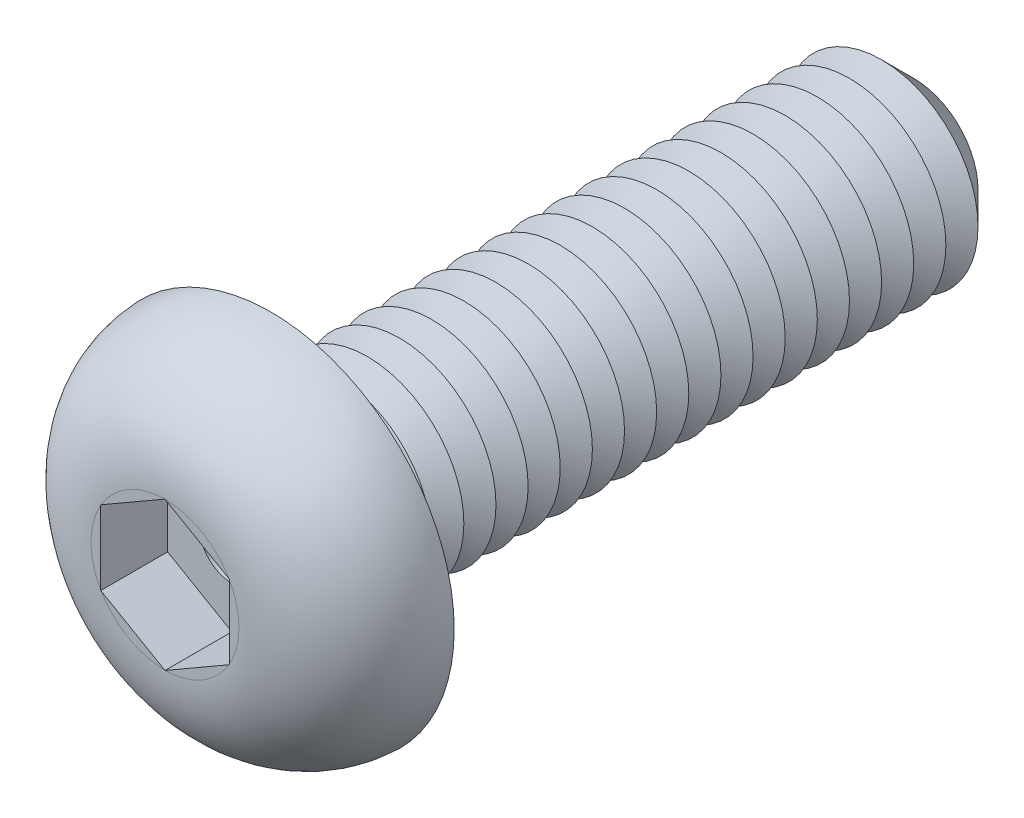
from build123d import *

# Parameters (mm, degrees)
CUT_EXTRUDE1_DEPTH  = 1.04
SKETCH4_R           = 1.5
BOSS_EXTRUDE1_DEPTH = 10
CHAMFER1_SIZE       = 0.5
LPATTERN1_COUNT     = 18
LPATTERN1_PITCH     = 0.5
FILLET2_R           = 0.25
SKETCH6_R           = 0.5
CUT_EXTRUDE2_DEPTH  = 10.61


with BuildPart() as part:
    # Sketch2 → Revolve1 (revolve)
    with BuildSketch(Plane(origin=(0, 0, 0), x_dir=(0, 0, -1), z_dir=(1, 0, 0)), mode=Mode.PRIVATE) as revolve1_sk:
        with BuildLine():
            Line((0, 0), (-1.65, 0))
            Line((-1.65, 0), (-1.65, 1.150735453))
            ThreePointArc((-1.65, 1.150735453), (-1.169631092, 2.335007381), (0, 2.85))
            Line((0, 2.85), (0, 0))
        make_face()
    revolve(revolve1_sk.sketch.rotate(Axis((0, 0, 47.934239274), (0, 0, -1)), 90), axis=Axis((0, 0, 47.934239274), (0, 0, -1)))

    # Sketch3 → Cut-Extrude1 (cut)
    with BuildSketch(Plane.XY.offset(1.65)):
        Polygon((0, 1.154700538), (-1, 0.577350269), (-1, -0.577350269), (0, -1.154700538), (1, -0.577350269), (1, 0.577350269), align=None)
    extrude(amount=-CUT_EXTRUDE1_DEPTH, mode=Mode.SUBTRACT)


with BuildPart() as cut_extrude1_kept_piece:
    # of the separate pieces the step leaves, the one the design keeps (cut_extrude1_pieces_kept)
    add(part.part.solids().sort_by_distance((2.85, 0, 0))[0])

    # Sketch4 → Boss-Extrude1 (add)
    with BuildSketch(Plane(origin=(0, 0, 0), x_dir=(-1, 0, 0), z_dir=(0, 0, -1))):
        with Locations(Location((0, 0, 0), (0, 0, 180))):
            Circle(SKETCH4_R)
    extrude(amount=BOSS_EXTRUDE1_DEPTH)

    # Chamfer1
    chamfer1_edges = [cut_extrude1_kept_piece.edges().sort_by_distance(p)[0] for p in [
        (-1.5, 0, -10),
    ]]
    chamfer(chamfer1_edges, length=CHAMFER1_SIZE)

    # Sketch5 → Cut-Revolve1 (revolve, cut)
    with BuildSketch(Plane(origin=(0, 0, 0), x_dir=(0, 0, -1), z_dir=(1, 0, 0)), mode=Mode.PRIVATE) as cut_revolve1_sk:
        Polygon((0.5, 1.5), (1, 1.5), (0.75, 1.066987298), align=None)
    cut_revolve1 = revolve(cut_revolve1_sk.sketch.rotate(Axis((0, 0, 47.934239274), (0, 0, -1)), 90), axis=Axis((0, 0, 47.934239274), (0, 0, -1)), mode=Mode.SUBTRACT)

    # LPattern1: Cut-Revolve1 ×18
    with Locations(*[(0, 0, -i * LPATTERN1_PITCH) for i in range(1, LPATTERN1_COUNT)]):
        add(cut_revolve1, mode=Mode.SUBTRACT)

    # Fillet2
    fillet2_edges = [cut_extrude1_kept_piece.edges().sort_by_distance(p)[0] for p in [
        (-1.5, 0, 0),
    ]]
    fillet(fillet2_edges, radius=FILLET2_R)

    # Sketch6 → Cut-Extrude2 (cut)
    with BuildSketch(Plane.XY.offset(0.61)):
        Circle(SKETCH6_R)
    extrude(amount=-CUT_EXTRUDE2_DEPTH, mode=Mode.SUBTRACT)


solid = cut_extrude1_kept_piece.part
